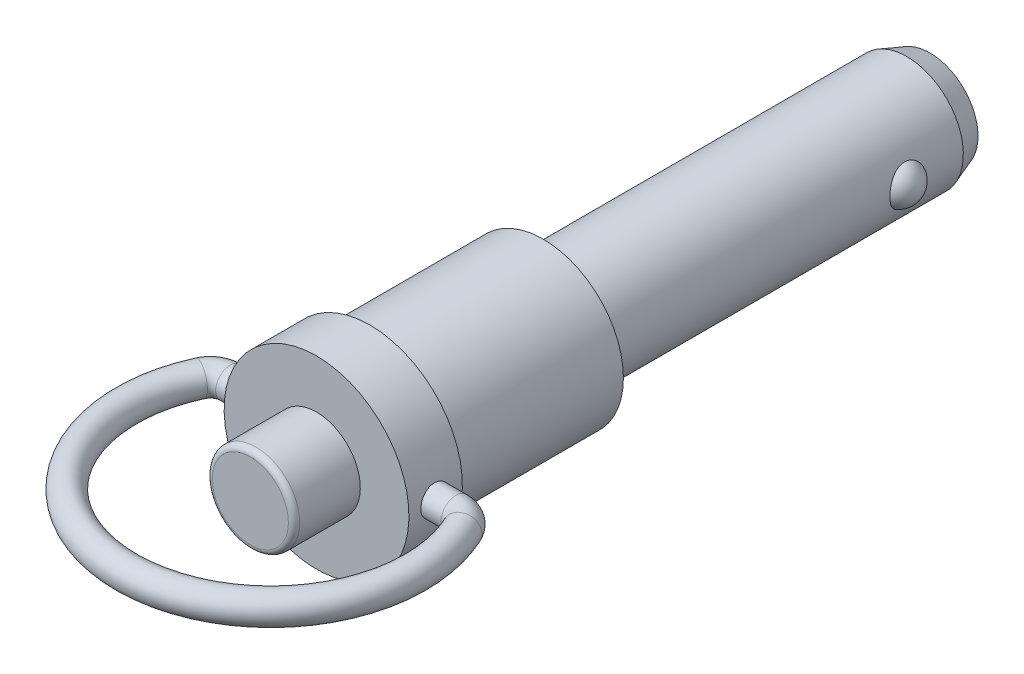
ISO-10303-21;
HEADER;
FILE_DESCRIPTION(('STEP AP214'),'2;1');
FILE_NAME('part.step','',(''),(''),'','','');
FILE_SCHEMA(('AUTOMOTIVE_DESIGN { 1 0 10303 214 1 1 1 1 }'));
ENDSEC;
DATA;
#1=APPLICATION_CONTEXT('core data for automotive mechanical design processes');
#2=APPLICATION_PROTOCOL_DEFINITION('international standard','automotive_design',2000,#1);
#3=PRODUCT_CONTEXT('',#1,'mechanical');
#4=PRODUCT('Part','Part','',(#3));
#5=PRODUCT_RELATED_PRODUCT_CATEGORY('part','',(#4));
#6=PRODUCT_DEFINITION_FORMATION('','',#4);
#7=PRODUCT_DEFINITION_CONTEXT('part definition',#1,'design');
#8=PRODUCT_DEFINITION('design','',#6,#7);
#9=PRODUCT_DEFINITION_SHAPE('','',#8);
#10=(LENGTH_UNIT() NAMED_UNIT(*) SI_UNIT(.MILLI.,.METRE.));
#11=(NAMED_UNIT(*) PLANE_ANGLE_UNIT() SI_UNIT($,.RADIAN.));
#12=(NAMED_UNIT(*) SI_UNIT($,.STERADIAN.) SOLID_ANGLE_UNIT());
#13=UNCERTAINTY_MEASURE_WITH_UNIT(LENGTH_MEASURE(1.E-05),#10,'distance_accuracy_value','');
#14=(GEOMETRIC_REPRESENTATION_CONTEXT(3) GLOBAL_UNCERTAINTY_ASSIGNED_CONTEXT((#13)) GLOBAL_UNIT_ASSIGNED_CONTEXT((#10,
#11,#12)) REPRESENTATION_CONTEXT('',''));
#15=CARTESIAN_POINT('',(0.,0.,0.));
#16=DIRECTION('',(0.,0.,1.));
#17=DIRECTION('',(1.,0.,0.));
#18=AXIS2_PLACEMENT_3D('',#15,#16,#17);
#19=CARTESIAN_POINT('',(0.,0.,24.765));
#20=DIRECTION('',(0.,0.,-1.));
#21=DIRECTION('',(0.,1.,0.));
#22=AXIS2_PLACEMENT_3D('',#19,#20,#21);
#23=CYLINDRICAL_SURFACE('',#22,3.8481);
#24=CARTESIAN_POINT('',(0.,0.,19.939));
#25=DIRECTION('',(0.,0.,-1.));
#26=DIRECTION('',(0.,1.,0.));
#27=AXIS2_PLACEMENT_3D('',#24,#25,#26);
#28=CIRCLE('',#27,3.8481);
#29=CARTESIAN_POINT('',(0.,3.8481,19.939));
#30=VERTEX_POINT('',#29);
#31=EDGE_CURVE('E31',#30,#30,#28,.T.);
#32=ORIENTED_EDGE('',*,*,#31,.F.);
#33=EDGE_LOOP('',(#32));
#34=FACE_BOUND('',#33,.T.);
#35=CARTESIAN_POINT('',(0.,0.,25.265));
#36=DIRECTION('',(0.,0.,1.));
#37=DIRECTION('',(1.,0.,0.));
#38=AXIS2_PLACEMENT_3D('',#35,#36,#37);
#39=CIRCLE('',#38,3.8481);
#40=CARTESIAN_POINT('',(3.8481,0.,25.265));
#41=VERTEX_POINT('',#40);
#42=EDGE_CURVE('E85',#41,#41,#39,.T.);
#43=ORIENTED_EDGE('',*,*,#42,.F.);
#44=EDGE_LOOP('',(#43));
#45=FACE_BOUND('',#44,.T.);
#46=ADVANCED_FACE('F13',(#34,#45),#23,.T.);
#47=CARTESIAN_POINT('',(8.128,0.,19.939));
#48=DIRECTION('',(0.,0.,1.));
#49=DIRECTION('',(0.,-1.,0.));
#50=AXIS2_PLACEMENT_3D('',#47,#48,#49);
#51=PLANE('',#50);
#52=ORIENTED_EDGE('',*,*,#31,.T.);
#53=EDGE_LOOP('',(#52));
#54=FACE_BOUND('',#53,.T.);
#55=CARTESIAN_POINT('',(0.,0.,19.939));
#56=DIRECTION('',(0.,0.,-1.));
#57=DIRECTION('',(0.,1.,0.));
#58=AXIS2_PLACEMENT_3D('',#55,#56,#57);
#59=CIRCLE('',#58,8.128);
#60=CARTESIAN_POINT('',(0.,8.128,19.939));
#61=VERTEX_POINT('',#60);
#62=EDGE_CURVE('E34',#61,#61,#59,.T.);
#63=ORIENTED_EDGE('',*,*,#62,.F.);
#64=EDGE_LOOP('',(#63));
#65=FACE_BOUND('',#64,.T.);
#66=ADVANCED_FACE('F150',(#54,#65),#51,.T.);
#67=CARTESIAN_POINT('',(0.,0.,0.));
#68=DIRECTION('',(0.,0.,-1.));
#69=DIRECTION('',(0.,1.,0.));
#70=AXIS2_PLACEMENT_3D('',#67,#68,#69);
#71=CYLINDRICAL_SURFACE('',#70,8.128);
#72=CARTESIAN_POINT('',(0.,0.,15.24));
#73=DIRECTION('',(0.,0.,-1.));
#74=DIRECTION('',(0.,1.,0.));
#75=AXIS2_PLACEMENT_3D('',#72,#73,#74);
#76=CIRCLE('',#75,8.128);
#77=CARTESIAN_POINT('',(0.,8.128,15.24));
#78=VERTEX_POINT('',#77);
#79=EDGE_CURVE('E38',#78,#78,#76,.T.);
#80=ORIENTED_EDGE('',*,*,#79,.F.);
#81=EDGE_LOOP('',(#80));
#82=FACE_BOUND('',#81,.T.);
#83=ORIENTED_EDGE('',*,*,#62,.T.);
#84=EDGE_LOOP('',(#83));
#85=FACE_BOUND('',#84,.T.);
#86=CARTESIAN_POINT('',(-8.02410885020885,1.2954,17.6022));
#87=CARTESIAN_POINT('',(-8.02411011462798,1.29539705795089,17.6744656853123));
#88=CARTESIAN_POINT('',(-8.02509566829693,1.28933237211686,17.7467719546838));
#89=CARTESIAN_POINT('',(-8.02892821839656,1.26524256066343,17.8893589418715));
#90=CARTESIAN_POINT('',(-8.03177697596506,1.24720611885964,17.9596376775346));
#91=CARTESIAN_POINT('',(-8.03900527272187,1.1997294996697,18.0960852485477));
#92=CARTESIAN_POINT('',(-8.04338357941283,1.17029850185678,18.1622573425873));
#93=CARTESIAN_POINT('',(-8.05317618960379,1.10089052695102,18.2887159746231));
#94=CARTESIAN_POINT('',(-8.0585903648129,1.06091485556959,18.3490032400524));
#95=CARTESIAN_POINT('',(-8.06989927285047,0.971167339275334,18.4625330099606));
#96=CARTESIAN_POINT('',(-8.07579753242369,0.921319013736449,18.5157147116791));
#97=CARTESIAN_POINT('',(-8.08737862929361,0.813406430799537,18.6129961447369));
#98=CARTESIAN_POINT('',(-8.0930614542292,0.755341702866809,18.6570953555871));
#99=CARTESIAN_POINT('',(-8.10360852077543,0.632252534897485,18.7351865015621));
#100=CARTESIAN_POINT('',(-8.10846813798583,0.56719192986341,18.7691221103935));
#101=CARTESIAN_POINT('',(-8.1167820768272,0.432203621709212,18.8255609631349));
#102=CARTESIAN_POINT('',(-8.12023648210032,0.362276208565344,18.8480648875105));
#103=CARTESIAN_POINT('',(-8.12532588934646,0.220166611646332,18.8808163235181));
#104=CARTESIAN_POINT('',(-8.1269760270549,0.148008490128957,18.8911658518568));
#105=CARTESIAN_POINT('',(-8.12832291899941,0.00296228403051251,18.8996317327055));
#106=CARTESIAN_POINT('',(-8.12801979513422,-0.0699257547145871,18.8977488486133));
#107=CARTESIAN_POINT('',(-8.12550634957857,-0.213665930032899,18.8818833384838));
#108=CARTESIAN_POINT('',(-8.12331333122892,-0.284530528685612,18.8680104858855));
#109=CARTESIAN_POINT('',(-8.1172857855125,-0.422912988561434,18.8287314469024));
#110=CARTESIAN_POINT('',(-8.11345121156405,-0.490430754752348,18.8033249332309));
#111=CARTESIAN_POINT('',(-8.10454181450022,-0.620532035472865,18.7415892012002));
#112=CARTESIAN_POINT('',(-8.09946182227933,-0.683093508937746,18.7052143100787));
#113=CARTESIAN_POINT('',(-8.08862678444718,-0.801266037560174,18.6226077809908));
#114=CARTESIAN_POINT('',(-8.08287168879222,-0.856876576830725,18.5763754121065));
#115=CARTESIAN_POINT('',(-8.07125190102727,-0.960216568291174,18.4747562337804));
#116=CARTESIAN_POINT('',(-8.06538670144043,-1.00785170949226,18.4192735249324));
#117=CARTESIAN_POINT('',(-8.05426976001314,-1.09315080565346,18.3010529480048));
#118=CARTESIAN_POINT('',(-8.04901802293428,-1.13081468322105,18.2383150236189));
#119=CARTESIAN_POINT('',(-8.03972254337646,-1.19511803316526,18.107260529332));
#120=CARTESIAN_POINT('',(-8.03567996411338,-1.22174689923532,18.0389386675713));
#121=CARTESIAN_POINT('',(-8.0292803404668,-1.26312461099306,17.8987131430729));
#122=CARTESIAN_POINT('',(-8.02692316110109,-1.27787440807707,17.8268097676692));
#123=CARTESIAN_POINT('',(-8.02418711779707,-1.29494404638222,17.6823039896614));
#124=CARTESIAN_POINT('',(-8.02378691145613,-1.29739799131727,17.6097178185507));
#125=CARTESIAN_POINT('',(-8.02495336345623,-1.29016294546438,17.465171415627));
#126=CARTESIAN_POINT('',(-8.02651995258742,-1.28047438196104,17.3932111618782));
#127=CARTESIAN_POINT('',(-8.03142381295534,-1.24934341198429,17.2523805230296));
#128=CARTESIAN_POINT('',(-8.03475089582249,-1.22796861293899,17.1834948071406));
#129=CARTESIAN_POINT('',(-8.04279238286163,-1.17414256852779,17.0502834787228));
#130=CARTESIAN_POINT('',(-8.04750686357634,-1.1416907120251,16.9859581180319));
#131=CARTESIAN_POINT('',(-8.05784184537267,-1.06631267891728,16.8630946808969));
#132=CARTESIAN_POINT('',(-8.06346967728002,-1.02330017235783,16.8046101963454));
#133=CARTESIAN_POINT('',(-8.07497552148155,-0.92814097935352,16.6956413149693));
#134=CARTESIAN_POINT('',(-8.08085354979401,-0.875993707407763,16.6451574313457));
#135=CARTESIAN_POINT('',(-8.09226462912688,-0.763452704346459,16.5531367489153));
#136=CARTESIAN_POINT('',(-8.09779388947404,-0.702985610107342,16.5116891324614));
#137=CARTESIAN_POINT('',(-8.1078244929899,-0.575868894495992,16.4395407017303));
#138=CARTESIAN_POINT('',(-8.11232586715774,-0.509219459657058,16.4088395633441));
#139=CARTESIAN_POINT('',(-8.11977698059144,-0.371900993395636,16.3591960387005));
#140=CARTESIAN_POINT('',(-8.12273299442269,-0.301249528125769,16.3402060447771));
#141=CARTESIAN_POINT('',(-8.12678676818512,-0.157709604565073,16.3143702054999));
#142=CARTESIAN_POINT('',(-8.12788466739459,-0.0848213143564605,16.3075234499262));
#143=CARTESIAN_POINT('',(-8.1280967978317,0.0602605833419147,16.3061928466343));
#144=CARTESIAN_POINT('',(-8.12723285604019,0.132452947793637,16.3115729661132));
#145=CARTESIAN_POINT('',(-8.12366268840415,0.274892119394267,16.3342503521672));
#146=CARTESIAN_POINT('',(-8.12095647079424,0.345138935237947,16.3515475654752));
#147=CARTESIAN_POINT('',(-8.11400457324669,0.481647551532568,16.3975176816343));
#148=CARTESIAN_POINT('',(-8.10976032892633,0.547913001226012,16.426179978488));
#149=CARTESIAN_POINT('',(-8.10019697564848,0.674715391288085,16.4940518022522));
#150=CARTESIAN_POINT('',(-8.09487782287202,0.735252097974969,16.5332617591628));
#151=CARTESIAN_POINT('',(-8.08368478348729,0.849566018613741,16.6216025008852));
#152=CARTESIAN_POINT('',(-8.07780565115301,0.903265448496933,16.6708332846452));
#153=CARTESIAN_POINT('',(-8.06619269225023,1.00168953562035,16.7776079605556));
#154=CARTESIAN_POINT('',(-8.06045890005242,1.04641208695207,16.8351537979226));
#155=CARTESIAN_POINT('',(-8.04974626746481,1.12587371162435,16.9573611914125));
#156=CARTESIAN_POINT('',(-8.0447724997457,1.16054698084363,17.0220659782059));
#157=CARTESIAN_POINT('',(-8.03620277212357,1.21848020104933,17.1564323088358));
#158=CARTESIAN_POINT('',(-8.03260541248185,1.24175175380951,17.2260887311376));
#159=CARTESIAN_POINT('',(-8.02800867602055,1.27106411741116,17.3470629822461));
#160=CARTESIAN_POINT('',(-8.02655420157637,1.2801757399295,17.3976414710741));
#161=CARTESIAN_POINT('',(-8.0246038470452,1.29234467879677,17.4995398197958));
#162=CARTESIAN_POINT('',(-8.0241079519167,1.29540209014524,17.5508596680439));
#163=CARTESIAN_POINT('',(-8.02410885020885,1.2954,17.6022));
#164=B_SPLINE_CURVE_WITH_KNOTS('',3,(#86,#87,#88,#89,#90,#91,#92,#93,#94,#95,#96,#97,#98,#99,
#100,#101,#102,#103,#104,#105,#106,#107,#108,#109,#110,#111,#112,#113,#114,#115,#116,#117,#118,
#119,#120,#121,#122,#123,#124,#125,#126,#127,#128,#129,#130,#131,#132,#133,#134,#135,#136,#137,
#138,#139,#140,#141,#142,#143,#144,#145,#146,#147,#148,#149,#150,#151,#152,#153,#154,#155,#156,
#157,#158,#159,#160,#161,#162,#163),.UNSPECIFIED.,.T.,.F.,(4,2,2,2,2,2,2,2,2,2,2,2,2,2,2,2,2,2,
2,2,2,2,2,2,2,2,2,2,2,2,2,2,2,2,2,2,2,2,4),(0.,0.216609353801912,0.433423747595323,
0.650063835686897,0.866677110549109,1.08503913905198,1.3034136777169,1.52297695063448,
1.74252715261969,1.96022110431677,2.17790147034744,2.39360973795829,2.60932412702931,
2.82594946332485,3.04259086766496,3.26163649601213,3.48068382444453,3.69994120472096,
3.91918102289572,4.13602443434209,4.35286021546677,4.56845462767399,4.7840609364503,
5.00149214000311,5.21893728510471,5.43844001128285,5.65793611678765,5.87653395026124,
6.09511539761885,6.31127688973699,6.52743741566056,6.7433966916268,6.95936477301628,
7.17760415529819,7.39589467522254,7.61558386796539,7.83504905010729,7.98893910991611,
8.14282675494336),.UNSPECIFIED.);
#165=CARTESIAN_POINT('',(-8.02410885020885,1.2954,17.6022));
#166=VERTEX_POINT('',#165);
#167=EDGE_CURVE('E28',#166,#166,#164,.T.);
#168=ORIENTED_EDGE('',*,*,#167,.T.);
#169=EDGE_LOOP('',(#168));
#170=FACE_BOUND('',#169,.T.);
#171=CARTESIAN_POINT('',(8.02410885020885,1.2954,17.6022));
#172=CARTESIAN_POINT('',(8.02411011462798,1.29539705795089,17.5299343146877));
#173=CARTESIAN_POINT('',(8.02509566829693,1.28933237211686,17.4576280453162));
#174=CARTESIAN_POINT('',(8.02892821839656,1.26524256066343,17.3150410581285));
#175=CARTESIAN_POINT('',(8.03177697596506,1.24720611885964,17.2447623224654));
#176=CARTESIAN_POINT('',(8.03900527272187,1.1997294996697,17.1083147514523));
#177=CARTESIAN_POINT('',(8.04338357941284,1.17029850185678,17.0421426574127));
#178=CARTESIAN_POINT('',(8.0531761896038,1.10089052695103,16.9156840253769));
#179=CARTESIAN_POINT('',(8.0585903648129,1.06091485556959,16.8553967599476));
#180=CARTESIAN_POINT('',(8.06989927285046,0.971167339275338,16.7418669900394));
#181=CARTESIAN_POINT('',(8.07579753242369,0.921319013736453,16.6886852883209));
#182=CARTESIAN_POINT('',(8.08737862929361,0.81340643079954,16.5914038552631));
#183=CARTESIAN_POINT('',(8.0930614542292,0.755341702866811,16.5473046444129));
#184=CARTESIAN_POINT('',(8.10360852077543,0.632252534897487,16.4692134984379));
#185=CARTESIAN_POINT('',(8.10846813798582,0.567191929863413,16.4352778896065));
#186=CARTESIAN_POINT('',(8.1167820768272,0.432203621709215,16.3788390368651));
#187=CARTESIAN_POINT('',(8.12023648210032,0.362276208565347,16.3563351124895));
#188=CARTESIAN_POINT('',(8.12532588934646,0.220166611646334,16.3235836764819));
#189=CARTESIAN_POINT('',(8.1269760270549,0.14800849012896,16.3132341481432));
#190=CARTESIAN_POINT('',(8.12832291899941,0.00296228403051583,16.3047682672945));
#191=CARTESIAN_POINT('',(8.12801979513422,-0.0699257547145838,16.3066511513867));
#192=CARTESIAN_POINT('',(8.12550634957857,-0.213665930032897,16.3225166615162));
#193=CARTESIAN_POINT('',(8.12331333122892,-0.28453052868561,16.3363895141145));
#194=CARTESIAN_POINT('',(8.1172857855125,-0.422912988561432,16.3756685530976));
#195=CARTESIAN_POINT('',(8.11345121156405,-0.490430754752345,16.4010750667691));
#196=CARTESIAN_POINT('',(8.10454181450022,-0.620532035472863,16.4628107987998));
#197=CARTESIAN_POINT('',(8.09946182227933,-0.683093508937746,16.4991856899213));
#198=CARTESIAN_POINT('',(8.08862678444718,-0.801266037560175,16.5817922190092));
#199=CARTESIAN_POINT('',(8.08287168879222,-0.856876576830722,16.6280245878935));
#200=CARTESIAN_POINT('',(8.07125190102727,-0.960216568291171,16.7296437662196));
#201=CARTESIAN_POINT('',(8.06538670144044,-1.00785170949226,16.7851264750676));
#202=CARTESIAN_POINT('',(8.05426976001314,-1.09315080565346,16.9033470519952));
#203=CARTESIAN_POINT('',(8.04901802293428,-1.13081468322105,16.9660849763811));
#204=CARTESIAN_POINT('',(8.03972254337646,-1.19511803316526,17.097139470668));
#205=CARTESIAN_POINT('',(8.03567996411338,-1.22174689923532,17.1654613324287));
#206=CARTESIAN_POINT('',(8.0292803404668,-1.26312461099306,17.3056868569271));
#207=CARTESIAN_POINT('',(8.02692316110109,-1.27787440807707,17.3775902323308));
#208=CARTESIAN_POINT('',(8.02418711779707,-1.29494404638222,17.5220960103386));
#209=CARTESIAN_POINT('',(8.02378691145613,-1.29739799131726,17.5946821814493));
#210=CARTESIAN_POINT('',(8.02495336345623,-1.29016294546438,17.739228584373));
#211=CARTESIAN_POINT('',(8.02651995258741,-1.28047438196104,17.8111888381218));
#212=CARTESIAN_POINT('',(8.03142381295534,-1.24934341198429,17.9520194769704));
#213=CARTESIAN_POINT('',(8.03475089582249,-1.22796861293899,18.0209051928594));
#214=CARTESIAN_POINT('',(8.04279238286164,-1.17414256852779,18.1541165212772));
#215=CARTESIAN_POINT('',(8.04750686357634,-1.1416907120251,18.2184418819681));
#216=CARTESIAN_POINT('',(8.05784184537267,-1.06631267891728,18.341305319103));
#217=CARTESIAN_POINT('',(8.06346967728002,-1.02330017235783,18.3997898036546));
#218=CARTESIAN_POINT('',(8.07497552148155,-0.928140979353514,18.5087586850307));
#219=CARTESIAN_POINT('',(8.08085354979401,-0.87599370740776,18.5592425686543));
#220=CARTESIAN_POINT('',(8.09226462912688,-0.763452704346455,18.6512632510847));
#221=CARTESIAN_POINT('',(8.09779388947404,-0.702985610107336,18.6927108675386));
#222=CARTESIAN_POINT('',(8.1078244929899,-0.575868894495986,18.7648592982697));
#223=CARTESIAN_POINT('',(8.11232586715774,-0.509219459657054,18.7955604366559));
#224=CARTESIAN_POINT('',(8.11977698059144,-0.371900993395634,18.8452039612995));
#225=CARTESIAN_POINT('',(8.12273299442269,-0.301249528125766,18.8641939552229));
#226=CARTESIAN_POINT('',(8.12678676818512,-0.157709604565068,18.8900297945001));
#227=CARTESIAN_POINT('',(8.12788466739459,-0.0848213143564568,18.8968765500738));
#228=CARTESIAN_POINT('',(8.1280967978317,0.0602605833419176,18.8982071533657));
#229=CARTESIAN_POINT('',(8.12723285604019,0.13245294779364,18.8928270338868));
#230=CARTESIAN_POINT('',(8.12366268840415,0.27489211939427,18.8701496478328));
#231=CARTESIAN_POINT('',(8.12095647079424,0.34513893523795,18.8528524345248));
#232=CARTESIAN_POINT('',(8.11400457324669,0.48164755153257,18.8068823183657));
#233=CARTESIAN_POINT('',(8.10976032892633,0.547913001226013,18.778220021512));
#234=CARTESIAN_POINT('',(8.10019697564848,0.674715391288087,18.7103481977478));
#235=CARTESIAN_POINT('',(8.09487782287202,0.735252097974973,18.6711382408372));
#236=CARTESIAN_POINT('',(8.08368478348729,0.849566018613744,18.5827974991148));
#237=CARTESIAN_POINT('',(8.07780565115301,0.903265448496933,18.5335667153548));
#238=CARTESIAN_POINT('',(8.06619269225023,1.00168953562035,18.4267920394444));
#239=CARTESIAN_POINT('',(8.06045890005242,1.04641208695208,18.3692462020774));
#240=CARTESIAN_POINT('',(8.04974626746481,1.12587371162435,18.2470388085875));
#241=CARTESIAN_POINT('',(8.0447724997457,1.16054698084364,18.1823340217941));
#242=CARTESIAN_POINT('',(8.03620277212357,1.21848020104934,18.0479676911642));
#243=CARTESIAN_POINT('',(8.03260541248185,1.24175175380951,17.9783112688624));
#244=CARTESIAN_POINT('',(8.02800867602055,1.27106411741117,17.8573370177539));
#245=CARTESIAN_POINT('',(8.02655420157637,1.2801757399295,17.8067585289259));
#246=CARTESIAN_POINT('',(8.0246038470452,1.29234467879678,17.7048601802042));
#247=CARTESIAN_POINT('',(8.0241079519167,1.29540209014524,17.6535403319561));
#248=CARTESIAN_POINT('',(8.02410885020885,1.2954,17.6022));
#249=B_SPLINE_CURVE_WITH_KNOTS('',3,(#171,#172,#173,#174,#175,#176,#177,#178,#179,#180,#181,
#182,#183,#184,#185,#186,#187,#188,#189,#190,#191,#192,#193,#194,#195,#196,#197,#198,#199,#200,
#201,#202,#203,#204,#205,#206,#207,#208,#209,#210,#211,#212,#213,#214,#215,#216,#217,#218,#219,
#220,#221,#222,#223,#224,#225,#226,#227,#228,#229,#230,#231,#232,#233,#234,#235,#236,#237,#238,
#239,#240,#241,#242,#243,#244,#245,#246,#247,#248),.UNSPECIFIED.,.T.,.F.,(4,2,2,2,2,2,2,2,2,2,2,
2,2,2,2,2,2,2,2,2,2,2,2,2,2,2,2,2,2,2,2,2,2,2,2,2,2,2,4),(0.,0.216609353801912,0.43342374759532,
0.650063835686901,0.866677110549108,1.08503913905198,1.3034136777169,1.52297695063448,
1.74252715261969,1.96022110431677,2.17790147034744,2.39360973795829,2.60932412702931,
2.82594946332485,3.04259086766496,3.26163649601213,3.48068382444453,3.69994120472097,
3.91918102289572,4.13602443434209,4.35286021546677,4.56845462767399,4.7840609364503,
5.00149214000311,5.21893728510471,5.43844001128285,5.65793611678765,5.87653395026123,
6.09511539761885,6.31127688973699,6.52743741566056,6.74339669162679,6.95936477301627,
7.17760415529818,7.39589467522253,7.61558386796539,7.83504905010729,7.98893910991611,
8.14282675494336),.UNSPECIFIED.);
#250=CARTESIAN_POINT('',(8.02410885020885,1.2954,17.6022));
#251=VERTEX_POINT('',#250);
#252=EDGE_CURVE('E24',#251,#251,#249,.T.);
#253=ORIENTED_EDGE('',*,*,#252,.T.);
#254=EDGE_LOOP('',(#253));
#255=FACE_BOUND('',#254,.T.);
#256=ADVANCED_FACE('F155',(#82,#85,#170,#255),#71,.T.);
#257=CARTESIAN_POINT('',(7.493,0.,15.24));
#258=DIRECTION('',(0.,0.,-1.));
#259=DIRECTION('',(0.,1.,0.));
#260=AXIS2_PLACEMENT_3D('',#257,#258,#259);
#261=PLANE('',#260);
#262=CARTESIAN_POINT('',(0.,0.,15.24));
#263=DIRECTION('',(0.,0.,-1.));
#264=DIRECTION('',(0.,1.,0.));
#265=AXIS2_PLACEMENT_3D('',#262,#263,#264);
#266=CIRCLE('',#265,7.45);
#267=CARTESIAN_POINT('',(0.,7.45,15.24));
#268=VERTEX_POINT('',#267);
#269=EDGE_CURVE('E20',#268,#268,#266,.F.);
#270=ORIENTED_EDGE('',*,*,#269,.T.);
#271=EDGE_LOOP('',(#270));
#272=FACE_BOUND('',#271,.T.);
#273=ORIENTED_EDGE('',*,*,#79,.T.);
#274=EDGE_LOOP('',(#273));
#275=FACE_BOUND('',#274,.T.);
#276=ADVANCED_FACE('F99',(#272,#275),#261,.T.);
#277=CARTESIAN_POINT('',(0.,0.,25.765));
#278=DIRECTION('',(0.,0.,1.));
#279=DIRECTION('',(1.,0.,0.));
#280=AXIS2_PLACEMENT_3D('',#277,#278,#279);
#281=PLANE('',#280);
#282=CARTESIAN_POINT('',(0.,0.,25.765));
#283=DIRECTION('',(0.,0.,1.));
#284=DIRECTION('',(1.,0.,0.));
#285=AXIS2_PLACEMENT_3D('',#282,#283,#284);
#286=CIRCLE('',#285,3.3481);
#287=CARTESIAN_POINT('',(3.3481,0.,25.765));
#288=VERTEX_POINT('',#287);
#289=EDGE_CURVE('E140',#288,#288,#286,.T.);
#290=ORIENTED_EDGE('',*,*,#289,.T.);
#291=EDGE_LOOP('',(#290));
#292=FACE_BOUND('',#291,.T.);
#293=ADVANCED_FACE('F95',(#292),#281,.T.);
#294=CARTESIAN_POINT('',(0.,0.,25.265));
#295=DIRECTION('',(0.,0.,1.));
#296=DIRECTION('',(1.,0.,0.));
#297=AXIS2_PLACEMENT_3D('',#294,#295,#296);
#298=TOROIDAL_SURFACE('',#297,3.3481,0.5);
#299=ORIENTED_EDGE('',*,*,#42,.T.);
#300=EDGE_LOOP('',(#299));
#301=FACE_BOUND('',#300,.T.);
#302=ORIENTED_EDGE('',*,*,#289,.F.);
#303=EDGE_LOOP('',(#302));
#304=FACE_BOUND('',#303,.T.);
#305=ADVANCED_FACE('F91',(#301,#304),#298,.T.);
#306=CARTESIAN_POINT('',(9.91901708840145,0.,19.3802));
#307=DIRECTION('',(0.,1.,0.));
#308=DIRECTION('',(-1.,0.,0.));
#309=AXIS2_PLACEMENT_3D('',#306,#307,#308);
#310=TOROIDAL_SURFACE('',#309,1.778,1.2954);
#311=CARTESIAN_POINT('',(11.5337408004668,0.,18.6359209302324));
#312=DIRECTION('',(-0.41860465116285,0.,-0.908168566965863));
#313=DIRECTION('',(0.908168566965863,0.,-0.41860465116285));
#314=AXIS2_PLACEMENT_3D('',#311,#312,#313);
#315=CIRCLE('',#314,1.2954);
#316=CARTESIAN_POINT('',(12.7101823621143,0.,18.093660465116));
#317=VERTEX_POINT('',#316);
#318=EDGE_CURVE('E42',#317,#317,#315,.T.);
#319=ORIENTED_EDGE('',*,*,#318,.T.);
#320=EDGE_LOOP('',(#319));
#321=FACE_BOUND('',#320,.T.);
#322=CARTESIAN_POINT('',(9.91901708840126,0.,17.6022));
#323=DIRECTION('',(1.,0.,0.));
#324=DIRECTION('',(0.,1.,0.));
#325=AXIS2_PLACEMENT_3D('',#322,#323,#324);
#326=CIRCLE('',#325,1.2954);
#327=CARTESIAN_POINT('',(9.91901708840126,1.2954,17.6022));
#328=VERTEX_POINT('',#327);
#329=EDGE_CURVE('E49',#328,#328,#326,.F.);
#330=ORIENTED_EDGE('',*,*,#329,.F.);
#331=EDGE_LOOP('',(#330));
#332=FACE_BOUND('',#331,.T.);
#333=ADVANCED_FACE('F66',(#321,#332),#310,.T.);
#334=CARTESIAN_POINT('',(-9.91901708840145,0.,17.6022));
#335=DIRECTION('',(1.,0.,0.));
#336=DIRECTION('',(0.,1.,0.));
#337=AXIS2_PLACEMENT_3D('',#334,#335,#336);
#338=CYLINDRICAL_SURFACE('',#337,1.2954);
#339=ORIENTED_EDGE('',*,*,#252,.F.);
#340=EDGE_LOOP('',(#339));
#341=FACE_BOUND('',#340,.T.);
#342=ORIENTED_EDGE('',*,*,#329,.T.);
#343=EDGE_LOOP('',(#342));
#344=FACE_BOUND('',#343,.T.);
#345=ADVANCED_FACE('F68',(#341,#344),#338,.T.);
#346=CARTESIAN_POINT('',(0.,0.,23.9522));
#347=DIRECTION('',(0.,1.,0.));
#348=DIRECTION('',(-1.,0.,0.));
#349=AXIS2_PLACEMENT_3D('',#346,#347,#348);
#350=TOROIDAL_SURFACE('',#349,12.7,1.2954);
#351=CARTESIAN_POINT('',(-11.5337408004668,0.,18.6359209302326));
#352=DIRECTION('',(-0.418604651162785,0.,0.908168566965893));
#353=DIRECTION('',(-0.908168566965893,0.,-0.418604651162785));
#354=AXIS2_PLACEMENT_3D('',#351,#352,#353);
#355=CIRCLE('',#354,1.2954);
#356=CARTESIAN_POINT('',(-12.7101823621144,0.,18.0936604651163));
#357=VERTEX_POINT('',#356);
#358=EDGE_CURVE('E45',#357,#357,#355,.F.);
#359=ORIENTED_EDGE('',*,*,#358,.F.);
#360=EDGE_LOOP('',(#359));
#361=FACE_BOUND('',#360,.T.);
#362=ORIENTED_EDGE('',*,*,#318,.F.);
#363=EDGE_LOOP('',(#362));
#364=FACE_BOUND('',#363,.T.);
#365=ADVANCED_FACE('F64',(#361,#364),#350,.T.);
#366=CARTESIAN_POINT('',(-9.91901708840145,0.,19.3802));
#367=DIRECTION('',(0.,1.,0.));
#368=DIRECTION('',(-1.,0.,0.));
#369=AXIS2_PLACEMENT_3D('',#366,#367,#368);
#370=TOROIDAL_SURFACE('',#369,1.77799999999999,1.2954);
#371=CARTESIAN_POINT('',(-9.91901708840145,0.,17.6022));
#372=DIRECTION('',(1.,0.,0.));
#373=DIRECTION('',(0.,1.,0.));
#374=AXIS2_PLACEMENT_3D('',#371,#372,#373);
#375=CIRCLE('',#374,1.2954);
#376=CARTESIAN_POINT('',(-9.91901708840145,1.2954,17.6022));
#377=VERTEX_POINT('',#376);
#378=EDGE_CURVE('E35',#377,#377,#375,.T.);
#379=ORIENTED_EDGE('',*,*,#378,.F.);
#380=EDGE_LOOP('',(#379));
#381=FACE_BOUND('',#380,.T.);
#382=ORIENTED_EDGE('',*,*,#358,.T.);
#383=EDGE_LOOP('',(#382));
#384=FACE_BOUND('',#383,.T.);
#385=ADVANCED_FACE('F59',(#381,#384),#370,.T.);
#386=CARTESIAN_POINT('',(-9.91901708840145,0.,17.6022));
#387=DIRECTION('',(1.,0.,0.));
#388=DIRECTION('',(0.,1.,0.));
#389=AXIS2_PLACEMENT_3D('',#386,#387,#388);
#390=CYLINDRICAL_SURFACE('',#389,1.2954);
#391=ORIENTED_EDGE('',*,*,#167,.F.);
#392=EDGE_LOOP('',(#391));
#393=FACE_BOUND('',#392,.T.);
#394=ORIENTED_EDGE('',*,*,#378,.T.);
#395=EDGE_LOOP('',(#394));
#396=FACE_BOUND('',#395,.T.);
#397=ADVANCED_FACE('F63',(#393,#396),#390,.T.);
#398=CARTESIAN_POINT('',(0.,0.,27.0467872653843));
#399=DIRECTION('',(0.,0.,1.));
#400=DIRECTION('',(1.,0.,0.));
#401=AXIS2_PLACEMENT_3D('',#398,#399,#400);
#402=CYLINDRICAL_SURFACE('',#401,7.05);
#403=CARTESIAN_POINT('',(0.,0.,14.84));
#404=DIRECTION('',(0.,0.,-1.));
#405=DIRECTION('',(0.,1.,0.));
#406=AXIS2_PLACEMENT_3D('',#403,#404,#405);
#407=CIRCLE('',#406,7.05);
#408=CARTESIAN_POINT('',(0.,7.05,14.84));
#409=VERTEX_POINT('',#408);
#410=EDGE_CURVE('E8',#409,#409,#407,.T.);
#411=ORIENTED_EDGE('',*,*,#410,.T.);
#412=EDGE_LOOP('',(#411));
#413=FACE_BOUND('',#412,.T.);
#414=CARTESIAN_POINT('',(0.,0.,0.));
#415=DIRECTION('',(0.,0.,1.));
#416=DIRECTION('',(1.,0.,0.));
#417=AXIS2_PLACEMENT_3D('',#414,#415,#416);
#418=CIRCLE('',#417,7.05);
#419=CARTESIAN_POINT('',(7.05,0.,0.));
#420=VERTEX_POINT('',#419);
#421=EDGE_CURVE('E177',#420,#420,#418,.T.);
#422=ORIENTED_EDGE('',*,*,#421,.T.);
#423=EDGE_LOOP('',(#422));
#424=FACE_BOUND('',#423,.T.);
#425=ADVANCED_FACE('F90',(#413,#424),#402,.T.);
#426=CARTESIAN_POINT('',(4.22992248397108,0.,-34.0106));
#427=DIRECTION('',(0.,0.,1.));
#428=DIRECTION('',(0.,-1.,0.));
#429=AXIS2_PLACEMENT_3D('',#426,#427,#428);
#430=PLANE('',#429);
#431=CARTESIAN_POINT('',(0.,0.,-34.0105999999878));
#432=DIRECTION('',(0.,0.,1.));
#433=DIRECTION('',(0.,-1.,0.));
#434=AXIS2_PLACEMENT_3D('',#431,#432,#433);
#435=CIRCLE('',#434,4.22992248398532);
#436=CARTESIAN_POINT('',(0.,-4.22992248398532,-34.0105999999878));
#437=VERTEX_POINT('',#436);
#438=EDGE_CURVE('E138',#437,#437,#435,.T.);
#439=ORIENTED_EDGE('',*,*,#438,.F.);
#440=EDGE_LOOP('',(#439));
#441=FACE_BOUND('',#440,.T.);
#442=ADVANCED_FACE('F101',(#441),#430,.F.);
#443=CARTESIAN_POINT('',(4.14528,0.,-27.1018));
#444=DIRECTION('',(0.,0.,1.));
#445=DIRECTION('',(1.,0.,0.));
#446=AXIS2_PLACEMENT_3D('',#443,#444,#445);
#447=SPHERICAL_SURFACE('',#446,1.78562);
#448=CARTESIAN_POINT('',(4.96951,0.,-25.5177912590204));
#449=CARTESIAN_POINT('',(4.96950607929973,0.0989420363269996,-25.5177939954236));
#450=CARTESIAN_POINT('',(4.96652601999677,0.197972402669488,-25.5255413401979));
#451=CARTESIAN_POINT('',(4.9548871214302,0.393364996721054,-25.5564575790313));
#452=CARTESIAN_POINT('',(4.94621961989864,0.489722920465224,-25.5796499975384));
#453=CARTESIAN_POINT('',(4.92409154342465,0.67692874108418,-25.6411551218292));
#454=CARTESIAN_POINT('',(4.91063084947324,0.76777650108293,-25.6794682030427));
#455=CARTESIAN_POINT('',(4.88035492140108,0.941233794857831,-25.7706319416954));
#456=CARTESIAN_POINT('',(4.86354066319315,1.02384571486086,-25.8234783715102));
#457=CARTESIAN_POINT('',(4.82872838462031,1.17707237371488,-25.9418991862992));
#458=CARTESIAN_POINT('',(4.81075207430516,1.2478494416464,-26.0072693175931));
#459=CARTESIAN_POINT('',(4.77554803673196,1.376454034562,-26.1499084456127));
#460=CARTESIAN_POINT('',(4.75832009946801,1.43428521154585,-26.2271740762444));
#461=CARTESIAN_POINT('',(4.7278067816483,1.53177669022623,-26.3868084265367));
#462=CARTESIAN_POINT('',(4.71434983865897,1.57230137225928,-26.4686150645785));
#463=CARTESIAN_POINT('',(4.69186742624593,1.63818072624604,-26.6386872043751));
#464=CARTESIAN_POINT('',(4.68283895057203,1.66354569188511,-26.7269482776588));
#465=CARTESIAN_POINT('',(4.6709836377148,1.69653228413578,-26.8994503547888));
#466=CARTESIAN_POINT('',(4.66770209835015,1.70545809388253,-26.9834120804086));
#467=CARTESIAN_POINT('',(4.66631401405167,1.70925445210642,-27.1516845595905));
#468=CARTESIAN_POINT('',(4.6682059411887,1.70412915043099,-27.2359952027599));
#469=CARTESIAN_POINT('',(4.67672634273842,1.68059540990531,-27.3985435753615));
#470=CARTESIAN_POINT('',(4.68313557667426,1.66280143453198,-27.4768831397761));
#471=CARTESIAN_POINT('',(4.69974058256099,1.61527018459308,-27.6294056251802));
#472=CARTESIAN_POINT('',(4.70993669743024,1.58553182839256,-27.7035881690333));
#473=CARTESIAN_POINT('',(4.73339939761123,1.51406854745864,-27.8481011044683));
#474=CARTESIAN_POINT('',(4.74674458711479,1.4720287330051,-27.9182634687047));
#475=CARTESIAN_POINT('',(4.76791353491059,1.40129782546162,-28.0176828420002));
#476=CARTESIAN_POINT('',(4.77516406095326,1.37643370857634,-28.049860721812));
#477=CARTESIAN_POINT('',(4.78988709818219,1.32429117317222,-28.112185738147));
#478=CARTESIAN_POINT('',(4.79735977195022,1.29701095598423,-28.1423313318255));
#479=CARTESIAN_POINT('',(4.82096563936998,1.20759667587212,-28.2338189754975));
#480=CARTESIAN_POINT('',(4.83719300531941,1.1414025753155,-28.2912462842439));
#481=CARTESIAN_POINT('',(4.86827537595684,1.00055962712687,-28.3950513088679));
#482=CARTESIAN_POINT('',(4.88312976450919,0.925907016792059,-28.441424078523));
#483=CARTESIAN_POINT('',(4.90385674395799,0.806241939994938,-28.5036735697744));
#484=CARTESIAN_POINT('',(4.91070233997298,0.763519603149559,-28.5237258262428));
#485=CARTESIAN_POINT('',(4.92344025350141,0.676535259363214,-28.5603862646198));
#486=CARTESIAN_POINT('',(4.92933338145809,0.632274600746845,-28.5769973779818));
#487=CARTESIAN_POINT('',(4.94535278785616,0.497629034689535,-28.6215733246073));
#488=CARTESIAN_POINT('',(4.95384366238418,0.405242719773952,-28.644351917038));
#489=CARTESIAN_POINT('',(4.96296311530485,0.260199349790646,-28.6686021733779));
#490=CARTESIAN_POINT('',(4.96541051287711,0.208410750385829,-28.6750499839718));
#491=CARTESIAN_POINT('',(4.96868499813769,0.104422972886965,-28.6836540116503));
#492=CARTESIAN_POINT('',(4.96951206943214,0.0522237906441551,-28.6858101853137));
#493=CARTESIAN_POINT('',(4.96950607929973,-0.0989420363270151,-28.6858060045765));
#494=CARTESIAN_POINT('',(4.96652601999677,-0.197972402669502,-28.6780586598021));
#495=CARTESIAN_POINT('',(4.9548871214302,-0.393364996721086,-28.6471424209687));
#496=CARTESIAN_POINT('',(4.94621961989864,-0.489722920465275,-28.6239500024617));
#497=CARTESIAN_POINT('',(4.92409154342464,-0.676928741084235,-28.5624448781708));
#498=CARTESIAN_POINT('',(4.91063084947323,-0.767776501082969,-28.5241317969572));
#499=CARTESIAN_POINT('',(4.88035492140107,-0.941233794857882,-28.4329680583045));
#500=CARTESIAN_POINT('',(4.86354066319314,-1.02384571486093,-28.3801216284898));
#501=CARTESIAN_POINT('',(4.8287283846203,-1.17707237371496,-28.2617008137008));
#502=CARTESIAN_POINT('',(4.81075207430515,-1.24784944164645,-28.1963306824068));
#503=CARTESIAN_POINT('',(4.77554803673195,-1.37645403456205,-28.0536915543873));
#504=CARTESIAN_POINT('',(4.758320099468,-1.4342852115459,-27.9764259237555));
#505=CARTESIAN_POINT('',(4.72780678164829,-1.53177669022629,-27.8167915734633));
#506=CARTESIAN_POINT('',(4.71434983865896,-1.57230137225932,-27.7349849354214));
#507=CARTESIAN_POINT('',(4.69186742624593,-1.63818072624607,-27.5649127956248));
#508=CARTESIAN_POINT('',(4.68283895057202,-1.66354569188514,-27.4766517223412));
#509=CARTESIAN_POINT('',(4.6709836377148,-1.6965322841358,-27.3041496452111));
#510=CARTESIAN_POINT('',(4.66770209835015,-1.70545809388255,-27.2201879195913));
#511=CARTESIAN_POINT('',(4.66631401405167,-1.70925445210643,-27.0519154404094));
#512=CARTESIAN_POINT('',(4.6682059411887,-1.70412915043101,-26.96760479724));
#513=CARTESIAN_POINT('',(4.67672634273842,-1.68059540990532,-26.8050564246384));
#514=CARTESIAN_POINT('',(4.68313557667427,-1.66280143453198,-26.7267168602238));
#515=CARTESIAN_POINT('',(4.699740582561,-1.61527018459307,-26.5741943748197));
#516=CARTESIAN_POINT('',(4.70993669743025,-1.58553182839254,-26.5000118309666));
#517=CARTESIAN_POINT('',(4.73339939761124,-1.51406854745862,-26.3554988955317));
#518=CARTESIAN_POINT('',(4.7467445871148,-1.47202873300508,-26.2853365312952));
#519=CARTESIAN_POINT('',(4.76791353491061,-1.40129782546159,-26.1859171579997));
#520=CARTESIAN_POINT('',(4.77516406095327,-1.37643370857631,-26.1537392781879));
#521=CARTESIAN_POINT('',(4.78988709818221,-1.32429117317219,-26.0914142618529));
#522=CARTESIAN_POINT('',(4.79735977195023,-1.2970109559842,-26.0612686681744));
#523=CARTESIAN_POINT('',(4.82096563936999,-1.20759667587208,-25.9697810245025));
#524=CARTESIAN_POINT('',(4.83719300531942,-1.14140257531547,-25.912353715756));
#525=CARTESIAN_POINT('',(4.86827537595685,-1.00055962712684,-25.8085486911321));
#526=CARTESIAN_POINT('',(4.8831297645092,-0.925907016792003,-25.762175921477));
#527=CARTESIAN_POINT('',(4.903856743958,-0.806241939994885,-25.6999264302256));
#528=CARTESIAN_POINT('',(4.91070233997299,-0.763519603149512,-25.6798741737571));
#529=CARTESIAN_POINT('',(4.92344025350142,-0.676535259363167,-25.6432137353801));
#530=CARTESIAN_POINT('',(4.9293333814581,-0.632274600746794,-25.6266026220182));
#531=CARTESIAN_POINT('',(4.94535278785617,-0.497629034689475,-25.5820266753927));
#532=CARTESIAN_POINT('',(4.95384366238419,-0.405242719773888,-25.559248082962));
#533=CARTESIAN_POINT('',(4.96296311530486,-0.260199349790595,-25.5349978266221));
#534=CARTESIAN_POINT('',(4.96541051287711,-0.208410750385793,-25.5285500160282));
#535=CARTESIAN_POINT('',(4.96868499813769,-0.104422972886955,-25.5199459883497));
#536=CARTESIAN_POINT('',(4.96951206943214,-0.0522237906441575,-25.5177898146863));
#537=CARTESIAN_POINT('',(4.96951,0.,-25.5177912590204));
#538=B_SPLINE_CURVE_WITH_KNOTS('',3,(#448,#449,#450,#451,#452,#453,#454,#455,#456,#457,#458,
#459,#460,#461,#462,#463,#464,#465,#466,#467,#468,#469,#470,#471,#472,#473,#474,#475,#476,#477,
#478,#479,#480,#481,#482,#483,#484,#485,#486,#487,#488,#489,#490,#491,#492,#493,#494,#495,#496,
#497,#498,#499,#500,#501,#502,#503,#504,#505,#506,#507,#508,#509,#510,#511,#512,#513,#514,#515,
#516,#517,#518,#519,#520,#521,#522,#523,#524,#525,#526,#527,#528,#529,#530,#531,#532,#533,#534,
#535,#536,#537),.UNSPECIFIED.,.T.,.F.,(4,2,2,2,2,2,2,2,2,2,2,2,2,2,2,2,2,2,2,2,2,2,2,2,2,2,2,2,
2,2,2,2,2,2,2,2,2,2,2,2,2,2,2,2,4),(0.,0.296633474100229,0.593719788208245,0.890813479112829,
1.18782083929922,1.4803431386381,1.77278281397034,2.04813279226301,2.32329559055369,
2.57549318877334,2.82761631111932,3.06827754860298,3.30896058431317,3.55644296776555,
3.68025851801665,3.80416703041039,4.07032015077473,4.33659213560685,4.47951069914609,
4.6223070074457,4.9074338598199,5.06400197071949,5.22057166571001,5.51720513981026,
5.81429145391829,6.11138514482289,6.40839250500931,6.70091480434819,6.99335447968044,
7.2687044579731,7.54386725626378,7.79606485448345,8.04818797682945,8.2888492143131,
8.52953225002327,8.77701463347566,8.90083018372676,9.0247386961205,9.29089181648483,
9.55716380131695,9.7000823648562,9.84287867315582,10.12800552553,10.2845736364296,
10.4411433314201),.UNSPECIFIED.);
#539=CARTESIAN_POINT('',(4.96951,0.,-25.5177912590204));
#540=VERTEX_POINT('',#539);
#541=EDGE_CURVE('E132',#540,#540,#538,.T.);
#542=ORIENTED_EDGE('',*,*,#541,.F.);
#543=EDGE_LOOP('',(#542));
#544=FACE_BOUND('',#543,.T.);
#545=ADVANCED_FACE('F104',(#544),#447,.T.);
#546=CARTESIAN_POINT('',(-4.14274,0.,-27.1018));
#547=DIRECTION('',(0.,0.,1.));
#548=DIRECTION('',(1.,0.,0.));
#549=AXIS2_PLACEMENT_3D('',#546,#547,#548);
#550=SPHERICAL_SURFACE('',#549,1.78562);
#551=CARTESIAN_POINT('',(-4.96951,0.,-28.6844844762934));
#552=CARTESIAN_POINT('',(-4.96950608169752,0.0989139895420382,-28.6844817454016));
#553=CARTESIAN_POINT('',(-4.96652771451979,0.197916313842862,-28.6767370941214));
#554=CARTESIAN_POINT('',(-4.95489537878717,0.393254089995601,-28.6458311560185));
#555=CARTESIAN_POINT('',(-4.94623274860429,0.489585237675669,-28.6226463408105));
#556=CARTESIAN_POINT('',(-4.92411699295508,0.676739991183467,-28.5611597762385));
#557=CARTESIAN_POINT('',(-4.91066371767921,0.767563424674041,-28.5228575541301));
#558=CARTESIAN_POINT('',(-4.88040469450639,0.940973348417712,-28.4317169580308));
#559=CARTESIAN_POINT('',(-4.86359992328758,1.02356222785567,-28.3788828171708));
#560=CARTESIAN_POINT('',(-4.82881079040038,1.17673191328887,-28.2604940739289));
#561=CARTESIAN_POINT('',(-4.81084830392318,1.24747651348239,-28.1951455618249));
#562=CARTESIAN_POINT('',(-4.77567379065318,1.37601594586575,-28.0525512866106));
#563=CARTESIAN_POINT('',(-4.75846155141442,1.43381446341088,-27.975308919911));
#564=CARTESIAN_POINT('',(-4.72798568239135,1.53122269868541,-27.8157481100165));
#565=CARTESIAN_POINT('',(-4.71454945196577,1.57170168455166,-27.7339947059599));
#566=CARTESIAN_POINT('',(-4.69210654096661,1.63749472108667,-27.5640357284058));
#567=CARTESIAN_POINT('',(-4.68309684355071,1.66281910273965,-27.4758345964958));
#568=CARTESIAN_POINT('',(-4.67127565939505,1.69572762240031,-27.3034786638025));
#569=CARTESIAN_POINT('',(-4.66800833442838,1.70461968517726,-27.219603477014));
#570=CARTESIAN_POINT('',(-4.66664096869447,1.70836155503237,-27.0515092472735));
#571=CARTESIAN_POINT('',(-4.66853940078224,1.70321551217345,-26.967290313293));
#572=CARTESIAN_POINT('',(-4.67706392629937,1.67965578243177,-26.8049283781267));
#573=CARTESIAN_POINT('',(-4.68347088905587,1.66185668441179,-26.7266833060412));
#574=CARTESIAN_POINT('',(-4.7000634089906,1.61433052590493,-26.5743485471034));
#575=CARTESIAN_POINT('',(-4.7102493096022,1.58460238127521,-26.5002592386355));
#576=CARTESIAN_POINT('',(-4.73368609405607,1.51317152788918,-26.3559218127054));
#577=CARTESIAN_POINT('',(-4.74701574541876,1.47115297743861,-26.2858423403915));
#578=CARTESIAN_POINT('',(-4.76815825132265,1.40046463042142,-26.1865421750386));
#579=CARTESIAN_POINT('',(-4.77539944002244,1.37561647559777,-26.1544031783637));
#580=CARTESIAN_POINT('',(-4.79010305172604,1.32350942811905,-26.0921539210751));
#581=CARTESIAN_POINT('',(-4.79756563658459,1.29624874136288,-26.0620452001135));
#582=CARTESIAN_POINT('',(-4.82114242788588,1.206888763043,-25.9706568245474));
#583=CARTESIAN_POINT('',(-4.83735008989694,1.14073361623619,-25.9132896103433));
#584=CARTESIAN_POINT('',(-4.8683937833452,0.999979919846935,-25.8095945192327));
#585=CARTESIAN_POINT('',(-4.88322919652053,0.925377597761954,-25.7632716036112));
#586=CARTESIAN_POINT('',(-4.90393144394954,0.805786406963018,-25.7010831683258));
#587=CARTESIAN_POINT('',(-4.91076989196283,0.763083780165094,-25.6810475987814));
#588=CARTESIAN_POINT('',(-4.92349428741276,0.676140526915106,-25.6444182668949));
#589=CARTESIAN_POINT('',(-4.92938104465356,0.631901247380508,-25.6278215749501));
#590=CARTESIAN_POINT('',(-4.94538285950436,0.497321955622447,-25.5832850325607));
#591=CARTESIAN_POINT('',(-4.95386398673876,0.404982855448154,-25.5605276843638));
#592=CARTESIAN_POINT('',(-4.96297201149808,0.260022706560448,-25.5363025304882));
#593=CARTESIAN_POINT('',(-4.96541608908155,0.208269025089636,-25.5298620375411));
#594=CARTESIAN_POINT('',(-4.96868612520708,0.104351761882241,-25.5212677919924));
#595=CARTESIAN_POINT('',(-4.96951206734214,0.0521881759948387,-25.5191140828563));
#596=CARTESIAN_POINT('',(-4.96950608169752,-0.0989139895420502,-25.5191182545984));
#597=CARTESIAN_POINT('',(-4.96652771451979,-0.197916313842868,-25.5268629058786));
#598=CARTESIAN_POINT('',(-4.95489537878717,-0.393254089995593,-25.5577688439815));
#599=CARTESIAN_POINT('',(-4.9462327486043,-0.489585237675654,-25.5809536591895));
#600=CARTESIAN_POINT('',(-4.92411699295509,-0.676739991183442,-25.6424402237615));
#601=CARTESIAN_POINT('',(-4.91066371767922,-0.767563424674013,-25.6807424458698));
#602=CARTESIAN_POINT('',(-4.8804046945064,-0.940973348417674,-25.7718830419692));
#603=CARTESIAN_POINT('',(-4.86359992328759,-1.02356222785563,-25.8247171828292));
#604=CARTESIAN_POINT('',(-4.82881079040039,-1.17673191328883,-25.943105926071));
#605=CARTESIAN_POINT('',(-4.8108483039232,-1.24747651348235,-26.0084544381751));
#606=CARTESIAN_POINT('',(-4.7756737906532,-1.37601594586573,-26.1510487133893));
#607=CARTESIAN_POINT('',(-4.75846155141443,-1.43381446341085,-26.2282910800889));
#608=CARTESIAN_POINT('',(-4.72798568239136,-1.5312226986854,-26.3878518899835));
#609=CARTESIAN_POINT('',(-4.71454945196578,-1.57170168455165,-26.4696052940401));
#610=CARTESIAN_POINT('',(-4.69210654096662,-1.63749472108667,-26.6395642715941));
#611=CARTESIAN_POINT('',(-4.68309684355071,-1.66281910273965,-26.7277654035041));
#612=CARTESIAN_POINT('',(-4.67127565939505,-1.69572762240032,-26.9001213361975));
#613=CARTESIAN_POINT('',(-4.66800833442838,-1.70461968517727,-26.983996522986));
#614=CARTESIAN_POINT('',(-4.66664096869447,-1.70836155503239,-27.1520907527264));
#615=CARTESIAN_POINT('',(-4.66853940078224,-1.70321551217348,-27.2363096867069));
#616=CARTESIAN_POINT('',(-4.67706392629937,-1.67965578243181,-27.3986716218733));
#617=CARTESIAN_POINT('',(-4.68347088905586,-1.66185668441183,-27.4769166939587));
#618=CARTESIAN_POINT('',(-4.70006340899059,-1.61433052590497,-27.6292514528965));
#619=CARTESIAN_POINT('',(-4.71024930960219,-1.58460238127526,-27.7033407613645));
#620=CARTESIAN_POINT('',(-4.73368609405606,-1.51317152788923,-27.8476781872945));
#621=CARTESIAN_POINT('',(-4.74701574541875,-1.47115297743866,-27.9177576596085));
#622=CARTESIAN_POINT('',(-4.76815825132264,-1.40046463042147,-28.0170578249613));
#623=CARTESIAN_POINT('',(-4.77539944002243,-1.37561647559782,-28.0491968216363));
#624=CARTESIAN_POINT('',(-4.79010305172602,-1.32350942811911,-28.1114460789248));
#625=CARTESIAN_POINT('',(-4.79756563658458,-1.29624874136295,-28.1415547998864));
#626=CARTESIAN_POINT('',(-4.82114242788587,-1.20688876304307,-28.2329431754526));
#627=CARTESIAN_POINT('',(-4.83735008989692,-1.14073361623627,-28.2903103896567));
#628=CARTESIAN_POINT('',(-4.86839378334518,-0.999979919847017,-28.3940054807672));
#629=CARTESIAN_POINT('',(-4.88322919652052,-0.925377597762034,-28.4403283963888));
#630=CARTESIAN_POINT('',(-4.90393144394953,-0.805786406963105,-28.5025168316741));
#631=CARTESIAN_POINT('',(-4.91076989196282,-0.763083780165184,-28.5225524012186));
#632=CARTESIAN_POINT('',(-4.92349428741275,-0.676140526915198,-28.5591817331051));
#633=CARTESIAN_POINT('',(-4.92938104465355,-0.631901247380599,-28.5757784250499));
#634=CARTESIAN_POINT('',(-4.94538285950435,-0.497321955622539,-28.6203149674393));
#635=CARTESIAN_POINT('',(-4.95386398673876,-0.404982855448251,-28.6430723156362));
#636=CARTESIAN_POINT('',(-4.96297201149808,-0.260022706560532,-28.6672974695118));
#637=CARTESIAN_POINT('',(-4.96541608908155,-0.208269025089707,-28.6737379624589));
#638=CARTESIAN_POINT('',(-4.96868612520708,-0.104351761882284,-28.6823322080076));
#639=CARTESIAN_POINT('',(-4.96951206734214,-0.0521881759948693,-28.6844859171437));
#640=CARTESIAN_POINT('',(-4.96951,0.,-28.6844844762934));
#641=B_SPLINE_CURVE_WITH_KNOTS('',3,(#551,#552,#553,#554,#555,#556,#557,#558,#559,#560,#561,
#562,#563,#564,#565,#566,#567,#568,#569,#570,#571,#572,#573,#574,#575,#576,#577,#578,#579,#580,
#581,#582,#583,#584,#585,#586,#587,#588,#589,#590,#591,#592,#593,#594,#595,#596,#597,#598,#599,
#600,#601,#602,#603,#604,#605,#606,#607,#608,#609,#610,#611,#612,#613,#614,#615,#616,#617,#618,
#619,#620,#621,#622,#623,#624,#625,#626,#627,#628,#629,#630,#631,#632,#633,#634,#635,#636,#637,
#638,#639,#640),.UNSPECIFIED.,.T.,.F.,(4,2,2,2,2,2,2,2,2,2,2,2,2,2,2,2,2,2,2,2,2,2,2,2,2,2,2,2,
2,2,2,2,2,2,2,2,2,2,2,2,2,2,2,2,4),(0.,0.296549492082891,0.593551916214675,0.89056362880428,
1.18748891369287,1.47988990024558,1.77220754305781,2.04734712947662,2.32229893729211,
2.5742274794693,2.82608155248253,3.06647154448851,3.30688338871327,3.55411689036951,
3.6778079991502,3.80159187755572,4.06753268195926,4.33359272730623,4.47643431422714,
4.61915370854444,4.90412739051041,5.06058877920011,5.21705175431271,5.51360124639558,
5.81060367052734,6.10761538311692,6.40454066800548,6.69694165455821,6.98925929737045,
7.26439888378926,7.53935069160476,7.79127923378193,8.04313330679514,8.28352329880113,
8.52393514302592,8.77116864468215,8.89485975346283,9.01864363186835,9.28458443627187,
9.55064448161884,9.69348606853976,9.83620546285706,10.121179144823,10.2776405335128,
10.4341035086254),.UNSPECIFIED.);
#642=CARTESIAN_POINT('',(-4.96951,0.,-28.6844844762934));
#643=VERTEX_POINT('',#642);
#644=EDGE_CURVE('E46',#643,#643,#641,.T.);
#645=ORIENTED_EDGE('',*,*,#644,.F.);
#646=EDGE_LOOP('',(#645));
#647=FACE_BOUND('',#646,.T.);
#648=ADVANCED_FACE('F110',(#647),#550,.T.);
#649=CARTESIAN_POINT('',(0.,0.,-31.9786000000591));
#650=DIRECTION('',(0.,0.,1.));
#651=DIRECTION('',(0.,-1.,0.));
#652=AXIS2_PLACEMENT_3D('',#649,#650,#651);
#653=CONICAL_SURFACE('',#652,4.96950999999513,0.349065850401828);
#654=ORIENTED_EDGE('',*,*,#438,.T.);
#655=EDGE_LOOP('',(#654));
#656=FACE_BOUND('',#655,.T.);
#657=CARTESIAN_POINT('',(0.,0.,-31.9786));
#658=DIRECTION('',(0.,0.,1.));
#659=DIRECTION('',(0.,-1.,0.));
#660=AXIS2_PLACEMENT_3D('',#657,#658,#659);
#661=CIRCLE('',#660,4.96951);
#662=CARTESIAN_POINT('',(0.,-4.96951000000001,-31.9786));
#663=VERTEX_POINT('',#662);
#664=EDGE_CURVE('E120',#663,#663,#661,.T.);
#665=ORIENTED_EDGE('',*,*,#664,.F.);
#666=EDGE_LOOP('',(#665));
#667=FACE_BOUND('',#666,.T.);
#668=ADVANCED_FACE('F112',(#656,#667),#653,.T.);
#669=CARTESIAN_POINT('',(0.,0.,0.));
#670=DIRECTION('',(0.,0.,1.));
#671=DIRECTION('',(0.,-1.,0.));
#672=AXIS2_PLACEMENT_3D('',#669,#670,#671);
#673=CYLINDRICAL_SURFACE('',#672,4.96951);
#674=ORIENTED_EDGE('',*,*,#664,.T.);
#675=EDGE_LOOP('',(#674));
#676=FACE_BOUND('',#675,.T.);
#677=ORIENTED_EDGE('',*,*,#644,.T.);
#678=EDGE_LOOP('',(#677));
#679=FACE_BOUND('',#678,.T.);
#680=CARTESIAN_POINT('',(0.,0.,0.));
#681=DIRECTION('',(0.,0.,-1.));
#682=DIRECTION('',(0.,1.,0.));
#683=AXIS2_PLACEMENT_3D('',#680,#681,#682);
#684=CIRCLE('',#683,4.96951);
#685=CARTESIAN_POINT('',(0.,4.96950999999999,0.));
#686=VERTEX_POINT('',#685);
#687=EDGE_CURVE('E41',#686,#686,#684,.F.);
#688=ORIENTED_EDGE('',*,*,#687,.F.);
#689=EDGE_LOOP('',(#688));
#690=FACE_BOUND('',#689,.T.);
#691=ORIENTED_EDGE('',*,*,#541,.T.);
#692=EDGE_LOOP('',(#691));
#693=FACE_BOUND('',#692,.T.);
#694=ADVANCED_FACE('F126',(#676,#679,#690,#693),#673,.T.);
#695=CARTESIAN_POINT('',(0.,0.,0.));
#696=DIRECTION('',(0.,0.,-1.));
#697=DIRECTION('',(0.,1.,0.));
#698=AXIS2_PLACEMENT_3D('',#695,#696,#697);
#699=PLANE('',#698);
#700=ORIENTED_EDGE('',*,*,#421,.F.);
#701=EDGE_LOOP('',(#700));
#702=FACE_BOUND('',#701,.T.);
#703=ORIENTED_EDGE('',*,*,#687,.T.);
#704=EDGE_LOOP('',(#703));
#705=FACE_BOUND('',#704,.T.);
#706=ADVANCED_FACE('F165',(#702,#705),#699,.T.);
#707=CARTESIAN_POINT('',(0.,0.,14.84));
#708=DIRECTION('',(0.,0.,-1.));
#709=DIRECTION('',(0.,1.,0.));
#710=AXIS2_PLACEMENT_3D('',#707,#708,#709);
#711=TOROIDAL_SURFACE('',#710,7.45,0.4);
#712=ORIENTED_EDGE('',*,*,#410,.F.);
#713=EDGE_LOOP('',(#712));
#714=FACE_BOUND('',#713,.T.);
#715=ORIENTED_EDGE('',*,*,#269,.F.);
#716=EDGE_LOOP('',(#715));
#717=FACE_BOUND('',#716,.T.);
#718=ADVANCED_FACE('F15',(#714,#717),#711,.F.);
#719=CLOSED_SHELL('',(#46,#66,#256,#276,#293,#305,#333,#345,#365,#385,#397,#425,#442,#545,#648,
#668,#694,#706,#718));
#720=MANIFOLD_SOLID_BREP('B1',#719);
#721=ADVANCED_BREP_SHAPE_REPRESENTATION('',(#18,#720),#14);
#722=SHAPE_DEFINITION_REPRESENTATION(#9,#721);
ENDSEC;
END-ISO-10303-21;
